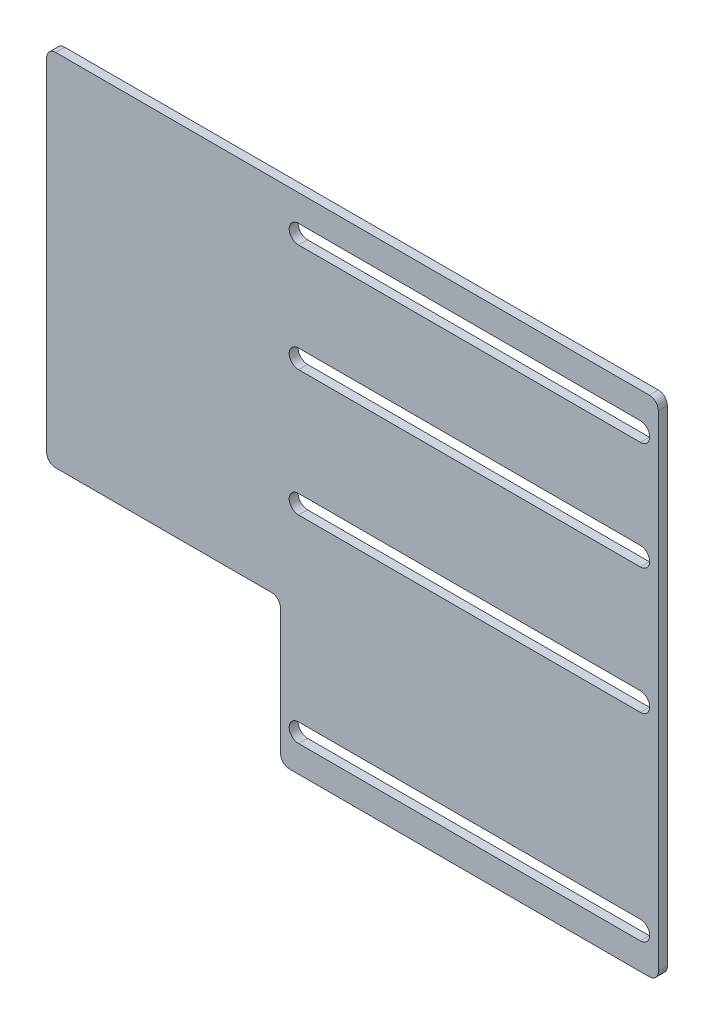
ISO-10303-21;
HEADER;
FILE_DESCRIPTION(('STEP AP214'),'2;1');
FILE_NAME('part.step','',(''),(''),'','','');
FILE_SCHEMA(('AUTOMOTIVE_DESIGN { 1 0 10303 214 1 1 1 1 }'));
ENDSEC;
DATA;
#1=APPLICATION_CONTEXT('core data for automotive mechanical design processes');
#2=APPLICATION_PROTOCOL_DEFINITION('international standard','automotive_design',2000,#1);
#3=PRODUCT_CONTEXT('',#1,'mechanical');
#4=PRODUCT('Part','Part','',(#3));
#5=PRODUCT_RELATED_PRODUCT_CATEGORY('part','',(#4));
#6=PRODUCT_DEFINITION_FORMATION('','',#4);
#7=PRODUCT_DEFINITION_CONTEXT('part definition',#1,'design');
#8=PRODUCT_DEFINITION('design','',#6,#7);
#9=PRODUCT_DEFINITION_SHAPE('','',#8);
#10=(LENGTH_UNIT() NAMED_UNIT(*) SI_UNIT(.MILLI.,.METRE.));
#11=(NAMED_UNIT(*) PLANE_ANGLE_UNIT() SI_UNIT($,.RADIAN.));
#12=(NAMED_UNIT(*) SI_UNIT($,.STERADIAN.) SOLID_ANGLE_UNIT());
#13=UNCERTAINTY_MEASURE_WITH_UNIT(LENGTH_MEASURE(1.E-05),#10,'distance_accuracy_value','');
#14=(GEOMETRIC_REPRESENTATION_CONTEXT(3) GLOBAL_UNCERTAINTY_ASSIGNED_CONTEXT((#13)) GLOBAL_UNIT_ASSIGNED_CONTEXT((#10,
#11,#12)) REPRESENTATION_CONTEXT('',''));
#15=CARTESIAN_POINT('',(0.,0.,0.));
#16=DIRECTION('',(0.,0.,1.));
#17=DIRECTION('',(1.,0.,0.));
#18=AXIS2_PLACEMENT_3D('',#15,#16,#17);
#19=CARTESIAN_POINT('',(133.35,0.,3.175));
#20=DIRECTION('',(0.,1.,0.));
#21=DIRECTION('',(-1.,0.,0.));
#22=AXIS2_PLACEMENT_3D('',#19,#20,#21);
#23=PLANE('',#22);
#24=DIRECTION('',(1.,0.,0.));
#25=VECTOR('',#24,1.);
#26=CARTESIAN_POINT('',(133.35,0.,0.));
#27=LINE('',#26,#25);
#28=CARTESIAN_POINT('',(3.17500000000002,0.,0.));
#29=VERTEX_POINT('',#28);
#30=CARTESIAN_POINT('',(130.175,0.,0.));
#31=VERTEX_POINT('',#30);
#32=EDGE_CURVE('E352',#29,#31,#27,.T.);
#33=ORIENTED_EDGE('',*,*,#32,.T.);
#34=DIRECTION('',(0.,0.,-1.));
#35=VECTOR('',#34,1.);
#36=CARTESIAN_POINT('',(130.175,0.,3.175));
#37=LINE('',#36,#35);
#38=CARTESIAN_POINT('',(130.175,0.,3.175));
#39=VERTEX_POINT('',#38);
#40=EDGE_CURVE('E409',#31,#39,#37,.F.);
#41=ORIENTED_EDGE('',*,*,#40,.T.);
#42=DIRECTION('',(1.,0.,0.));
#43=VECTOR('',#42,1.);
#44=CARTESIAN_POINT('',(133.35,0.,3.175));
#45=LINE('',#44,#43);
#46=CARTESIAN_POINT('',(3.17500000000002,0.,3.175));
#47=VERTEX_POINT('',#46);
#48=EDGE_CURVE('E359',#47,#39,#45,.T.);
#49=ORIENTED_EDGE('',*,*,#48,.F.);
#50=DIRECTION('',(0.,0.,-1.));
#51=VECTOR('',#50,1.);
#52=CARTESIAN_POINT('',(3.17500000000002,0.,3.175));
#53=LINE('',#52,#51);
#54=EDGE_CURVE('E406',#47,#29,#53,.T.);
#55=ORIENTED_EDGE('',*,*,#54,.T.);
#56=EDGE_LOOP('',(#33,#41,#49,#55));
#57=FACE_BOUND('',#56,.T.);
#58=ADVANCED_FACE('F34',(#57),#23,.F.);
#59=CARTESIAN_POINT('',(133.35,177.8,3.17500000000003));
#60=DIRECTION('',(-1.,0.,0.));
#61=DIRECTION('',(0.,-1.,0.));
#62=AXIS2_PLACEMENT_3D('',#59,#60,#61);
#63=PLANE('',#62);
#64=DIRECTION('',(0.,1.,0.));
#65=VECTOR('',#64,1.);
#66=CARTESIAN_POINT('',(133.35,177.8,3.17500000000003));
#67=LINE('',#66,#65);
#68=CARTESIAN_POINT('',(133.35,3.17499999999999,3.175));
#69=VERTEX_POINT('',#68);
#70=CARTESIAN_POINT('',(133.35,174.625,3.17500000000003));
#71=VERTEX_POINT('',#70);
#72=EDGE_CURVE('E362',#69,#71,#67,.T.);
#73=ORIENTED_EDGE('',*,*,#72,.F.);
#74=DIRECTION('',(0.,0.,-1.));
#75=VECTOR('',#74,1.);
#76=CARTESIAN_POINT('',(133.35,3.17499999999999,3.175));
#77=LINE('',#76,#75);
#78=CARTESIAN_POINT('',(133.35,3.17499999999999,0.));
#79=VERTEX_POINT('',#78);
#80=EDGE_CURVE('E393',#69,#79,#77,.T.);
#81=ORIENTED_EDGE('',*,*,#80,.T.);
#82=DIRECTION('',(0.,1.,0.));
#83=VECTOR('',#82,1.);
#84=CARTESIAN_POINT('',(133.35,177.8,0.));
#85=LINE('',#84,#83);
#86=CARTESIAN_POINT('',(133.35,174.625,0.));
#87=VERTEX_POINT('',#86);
#88=EDGE_CURVE('E379',#79,#87,#85,.T.);
#89=ORIENTED_EDGE('',*,*,#88,.T.);
#90=DIRECTION('',(0.,0.,-1.));
#91=VECTOR('',#90,1.);
#92=CARTESIAN_POINT('',(133.35,174.625,3.17500000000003));
#93=LINE('',#92,#91);
#94=EDGE_CURVE('E376',#87,#71,#93,.F.);
#95=ORIENTED_EDGE('',*,*,#94,.T.);
#96=EDGE_LOOP('',(#73,#81,#89,#95));
#97=FACE_BOUND('',#96,.T.);
#98=ADVANCED_FACE('F467',(#97),#63,.F.);
#99=CARTESIAN_POINT('',(-82.5500000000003,177.8,3.17500000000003));
#100=DIRECTION('',(0.,-1.,0.));
#101=DIRECTION('',(0.,0.,-1.));
#102=AXIS2_PLACEMENT_3D('',#99,#100,#101);
#103=PLANE('',#102);
#104=DIRECTION('',(-1.,0.,0.));
#105=VECTOR('',#104,1.);
#106=CARTESIAN_POINT('',(-82.5500000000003,177.8,3.17500000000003));
#107=LINE('',#106,#105);
#108=CARTESIAN_POINT('',(130.175,177.8,3.17500000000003));
#109=VERTEX_POINT('',#108);
#110=CARTESIAN_POINT('',(-79.3750000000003,177.8,3.17500000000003));
#111=VERTEX_POINT('',#110);
#112=EDGE_CURVE('E366',#109,#111,#107,.T.);
#113=ORIENTED_EDGE('',*,*,#112,.F.);
#114=DIRECTION('',(0.,0.,-1.));
#115=VECTOR('',#114,1.);
#116=CARTESIAN_POINT('',(130.175,177.8,3.17500000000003));
#117=LINE('',#116,#115);
#118=CARTESIAN_POINT('',(130.175,177.8,0.));
#119=VERTEX_POINT('',#118);
#120=EDGE_CURVE('E423',#109,#119,#117,.T.);
#121=ORIENTED_EDGE('',*,*,#120,.T.);
#122=DIRECTION('',(-1.,0.,0.));
#123=VECTOR('',#122,1.);
#124=CARTESIAN_POINT('',(-82.5500000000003,177.8,0.));
#125=LINE('',#124,#123);
#126=CARTESIAN_POINT('',(-79.3750000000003,177.8,0.));
#127=VERTEX_POINT('',#126);
#128=EDGE_CURVE('E382',#119,#127,#125,.T.);
#129=ORIENTED_EDGE('',*,*,#128,.T.);
#130=DIRECTION('',(0.,0.,-1.));
#131=VECTOR('',#130,1.);
#132=CARTESIAN_POINT('',(-79.3750000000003,177.8,3.17500000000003));
#133=LINE('',#132,#131);
#134=EDGE_CURVE('E421',#127,#111,#133,.F.);
#135=ORIENTED_EDGE('',*,*,#134,.T.);
#136=EDGE_LOOP('',(#113,#121,#129,#135));
#137=FACE_BOUND('',#136,.T.);
#138=ADVANCED_FACE('F476',(#137),#103,.F.);
#139=CARTESIAN_POINT('',(-82.5500000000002,50.8,3.17500000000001));
#140=DIRECTION('',(1.,0.,0.));
#141=DIRECTION('',(0.,1.,0.));
#142=AXIS2_PLACEMENT_3D('',#139,#140,#141);
#143=PLANE('',#142);
#144=DIRECTION('',(0.,-1.,0.));
#145=VECTOR('',#144,1.);
#146=CARTESIAN_POINT('',(-82.5500000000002,50.8,0.));
#147=LINE('',#146,#145);
#148=CARTESIAN_POINT('',(-82.5500000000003,174.625,0.));
#149=VERTEX_POINT('',#148);
#150=CARTESIAN_POINT('',(-82.5500000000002,53.975,0.));
#151=VERTEX_POINT('',#150);
#152=EDGE_CURVE('E385',#149,#151,#147,.T.);
#153=ORIENTED_EDGE('',*,*,#152,.T.);
#154=DIRECTION('',(0.,0.,-1.));
#155=VECTOR('',#154,1.);
#156=CARTESIAN_POINT('',(-82.5500000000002,53.975,3.17500000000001));
#157=LINE('',#156,#155);
#158=CARTESIAN_POINT('',(-82.5500000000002,53.975,3.17500000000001));
#159=VERTEX_POINT('',#158);
#160=EDGE_CURVE('E438',#151,#159,#157,.F.);
#161=ORIENTED_EDGE('',*,*,#160,.T.);
#162=DIRECTION('',(0.,-1.,0.));
#163=VECTOR('',#162,1.);
#164=CARTESIAN_POINT('',(-82.5500000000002,50.8,3.17500000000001));
#165=LINE('',#164,#163);
#166=CARTESIAN_POINT('',(-82.5500000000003,174.625,3.17500000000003));
#167=VERTEX_POINT('',#166);
#168=EDGE_CURVE('E369',#167,#159,#165,.T.);
#169=ORIENTED_EDGE('',*,*,#168,.F.);
#170=DIRECTION('',(0.,0.,-1.));
#171=VECTOR('',#170,1.);
#172=CARTESIAN_POINT('',(-82.5500000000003,174.625,3.17500000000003));
#173=LINE('',#172,#171);
#174=EDGE_CURVE('E435',#167,#149,#173,.T.);
#175=ORIENTED_EDGE('',*,*,#174,.T.);
#176=EDGE_LOOP('',(#153,#161,#169,#175));
#177=FACE_BOUND('',#176,.T.);
#178=ADVANCED_FACE('F484',(#177),#143,.F.);
#179=CARTESIAN_POINT('',(0.,50.8,3.17500000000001));
#180=DIRECTION('',(0.,1.,0.));
#181=DIRECTION('',(-1.,0.,0.));
#182=AXIS2_PLACEMENT_3D('',#179,#180,#181);
#183=PLANE('',#182);
#184=DIRECTION('',(1.,0.,0.));
#185=VECTOR('',#184,1.);
#186=CARTESIAN_POINT('',(0.,50.8,0.));
#187=LINE('',#186,#185);
#188=CARTESIAN_POINT('',(-79.3750000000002,50.8,0.));
#189=VERTEX_POINT('',#188);
#190=CARTESIAN_POINT('',(-3.17500000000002,50.8,0.));
#191=VERTEX_POINT('',#190);
#192=EDGE_CURVE('E388',#189,#191,#187,.T.);
#193=ORIENTED_EDGE('',*,*,#192,.T.);
#194=DIRECTION('',(0.,0.,-1.));
#195=VECTOR('',#194,1.);
#196=CARTESIAN_POINT('',(-3.17500000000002,50.8,3.17500000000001));
#197=LINE('',#196,#195);
#198=CARTESIAN_POINT('',(-3.17500000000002,50.8,3.17500000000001));
#199=VERTEX_POINT('',#198);
#200=EDGE_CURVE('E433',#191,#199,#197,.F.);
#201=ORIENTED_EDGE('',*,*,#200,.T.);
#202=DIRECTION('',(1.,0.,0.));
#203=VECTOR('',#202,1.);
#204=CARTESIAN_POINT('',(0.,50.8,3.17500000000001));
#205=LINE('',#204,#203);
#206=CARTESIAN_POINT('',(-79.3750000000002,50.8,3.17500000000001));
#207=VERTEX_POINT('',#206);
#208=EDGE_CURVE('E372',#207,#199,#205,.T.);
#209=ORIENTED_EDGE('',*,*,#208,.F.);
#210=DIRECTION('',(0.,0.,-1.));
#211=VECTOR('',#210,1.);
#212=CARTESIAN_POINT('',(-79.3750000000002,50.8,3.17500000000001));
#213=LINE('',#212,#211);
#214=EDGE_CURVE('E430',#207,#189,#213,.T.);
#215=ORIENTED_EDGE('',*,*,#214,.T.);
#216=EDGE_LOOP('',(#193,#201,#209,#215));
#217=FACE_BOUND('',#216,.T.);
#218=ADVANCED_FACE('F447',(#217),#183,.F.);
#219=CARTESIAN_POINT('',(0.,0.,3.175));
#220=DIRECTION('',(1.,0.,0.));
#221=DIRECTION('',(0.,0.,-1.));
#222=AXIS2_PLACEMENT_3D('',#219,#220,#221);
#223=PLANE('',#222);
#224=DIRECTION('',(0.,-1.,0.));
#225=VECTOR('',#224,1.);
#226=CARTESIAN_POINT('',(0.,0.,3.175));
#227=LINE('',#226,#225);
#228=CARTESIAN_POINT('',(0.,47.625,3.17500000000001));
#229=VERTEX_POINT('',#228);
#230=CARTESIAN_POINT('',(0.,3.175,3.175));
#231=VERTEX_POINT('',#230);
#232=EDGE_CURVE('E374',#229,#231,#227,.T.);
#233=ORIENTED_EDGE('',*,*,#232,.F.);
#234=DIRECTION('',(0.,0.,-1.));
#235=VECTOR('',#234,1.);
#236=CARTESIAN_POINT('',(0.,47.625,0.));
#237=LINE('',#236,#235);
#238=CARTESIAN_POINT('',(0.,47.625,0.));
#239=VERTEX_POINT('',#238);
#240=EDGE_CURVE('E427',#229,#239,#237,.T.);
#241=ORIENTED_EDGE('',*,*,#240,.T.);
#242=DIRECTION('',(0.,-1.,0.));
#243=VECTOR('',#242,1.);
#244=CARTESIAN_POINT('',(0.,0.,0.));
#245=LINE('',#244,#243);
#246=CARTESIAN_POINT('',(0.,3.175,0.));
#247=VERTEX_POINT('',#246);
#248=EDGE_CURVE('E363',#239,#247,#245,.T.);
#249=ORIENTED_EDGE('',*,*,#248,.T.);
#250=DIRECTION('',(0.,0.,-1.));
#251=VECTOR('',#250,1.);
#252=CARTESIAN_POINT('',(0.,3.175,3.175));
#253=LINE('',#252,#251);
#254=EDGE_CURVE('E49',#247,#231,#253,.F.);
#255=ORIENTED_EDGE('',*,*,#254,.T.);
#256=EDGE_LOOP('',(#233,#241,#249,#255));
#257=FACE_BOUND('',#256,.T.);
#258=ADVANCED_FACE('F451',(#257),#223,.F.);
#259=CARTESIAN_POINT('',(0.,0.,3.175));
#260=DIRECTION('',(0.,0.,-1.));
#261=DIRECTION('',(-1.,0.,0.));
#262=AXIS2_PLACEMENT_3D('',#259,#260,#261);
#263=PLANE('',#262);
#264=DIRECTION('',(1.,0.,0.));
#265=VECTOR('',#264,1.);
#266=CARTESIAN_POINT('',(6.34999999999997,9.398,3.175));
#267=LINE('',#266,#265);
#268=CARTESIAN_POINT('',(6.34999999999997,9.398,3.175));
#269=VERTEX_POINT('',#268);
#270=CARTESIAN_POINT('',(127.,9.39799999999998,3.175));
#271=VERTEX_POINT('',#270);
#272=EDGE_CURVE('E253',#269,#271,#267,.T.);
#273=ORIENTED_EDGE('',*,*,#272,.F.);
#274=CARTESIAN_POINT('',(6.34999999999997,12.7,3.175));
#275=DIRECTION('',(0.,0.,1.));
#276=DIRECTION('',(1.,0.,0.));
#277=AXIS2_PLACEMENT_3D('',#274,#275,#276);
#278=CIRCLE('',#277,3.302);
#279=CARTESIAN_POINT('',(6.34999999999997,16.002,3.175));
#280=VERTEX_POINT('',#279);
#281=EDGE_CURVE('E226',#280,#269,#278,.T.);
#282=ORIENTED_EDGE('',*,*,#281,.F.);
#283=DIRECTION('',(-1.,0.,0.));
#284=VECTOR('',#283,1.);
#285=CARTESIAN_POINT('',(6.34999999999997,16.002,3.175));
#286=LINE('',#285,#284);
#287=CARTESIAN_POINT('',(127.,16.002,3.175));
#288=VERTEX_POINT('',#287);
#289=EDGE_CURVE('E244',#288,#280,#286,.T.);
#290=ORIENTED_EDGE('',*,*,#289,.F.);
#291=CARTESIAN_POINT('',(127.,12.7,3.175));
#292=DIRECTION('',(0.,0.,1.));
#293=DIRECTION('',(1.,0.,0.));
#294=AXIS2_PLACEMENT_3D('',#291,#292,#293);
#295=CIRCLE('',#294,3.302);
#296=EDGE_CURVE('E247',#271,#288,#295,.T.);
#297=ORIENTED_EDGE('',*,*,#296,.F.);
#298=EDGE_LOOP('',(#273,#282,#290,#297));
#299=FACE_BOUND('',#298,.T.);
#300=DIRECTION('',(1.,0.,0.));
#301=VECTOR('',#300,1.);
#302=CARTESIAN_POINT('',(6.34999999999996,79.248,3.17500000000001));
#303=LINE('',#302,#301);
#304=CARTESIAN_POINT('',(6.34999999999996,79.248,3.17500000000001));
#305=VERTEX_POINT('',#304);
#306=CARTESIAN_POINT('',(127.,79.248,3.17500000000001));
#307=VERTEX_POINT('',#306);
#308=EDGE_CURVE('E278',#305,#307,#303,.T.);
#309=ORIENTED_EDGE('',*,*,#308,.F.);
#310=CARTESIAN_POINT('',(6.34999999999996,82.55,3.17500000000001));
#311=DIRECTION('',(0.,0.,1.));
#312=DIRECTION('',(1.,0.,0.));
#313=AXIS2_PLACEMENT_3D('',#310,#311,#312);
#314=CIRCLE('',#313,3.302);
#315=CARTESIAN_POINT('',(6.34999999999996,85.852,3.17500000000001));
#316=VERTEX_POINT('',#315);
#317=EDGE_CURVE('E259',#316,#305,#314,.T.);
#318=ORIENTED_EDGE('',*,*,#317,.F.);
#319=DIRECTION('',(-1.,0.,0.));
#320=VECTOR('',#319,1.);
#321=CARTESIAN_POINT('',(6.34999999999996,85.852,3.17500000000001));
#322=LINE('',#321,#320);
#323=CARTESIAN_POINT('',(127.,85.852,3.17500000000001));
#324=VERTEX_POINT('',#323);
#325=EDGE_CURVE('E267',#324,#316,#322,.T.);
#326=ORIENTED_EDGE('',*,*,#325,.F.);
#327=CARTESIAN_POINT('',(127.,82.55,3.17500000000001));
#328=DIRECTION('',(0.,0.,1.));
#329=DIRECTION('',(1.,0.,0.));
#330=AXIS2_PLACEMENT_3D('',#327,#328,#329);
#331=CIRCLE('',#330,3.302);
#332=EDGE_CURVE('E281',#307,#324,#331,.T.);
#333=ORIENTED_EDGE('',*,*,#332,.F.);
#334=EDGE_LOOP('',(#309,#318,#326,#333));
#335=FACE_BOUND('',#334,.T.);
#336=DIRECTION('',(1.,0.,0.));
#337=VECTOR('',#336,1.);
#338=CARTESIAN_POINT('',(6.34999999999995,123.698,3.17500000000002));
#339=LINE('',#338,#337);
#340=CARTESIAN_POINT('',(6.34999999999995,123.698,3.17500000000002));
#341=VERTEX_POINT('',#340);
#342=CARTESIAN_POINT('',(127.,123.698,3.17500000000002));
#343=VERTEX_POINT('',#342);
#344=EDGE_CURVE('E310',#341,#343,#339,.T.);
#345=ORIENTED_EDGE('',*,*,#344,.F.);
#346=CARTESIAN_POINT('',(6.34999999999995,127.,3.17500000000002));
#347=DIRECTION('',(0.,0.,1.));
#348=DIRECTION('',(1.,0.,0.));
#349=AXIS2_PLACEMENT_3D('',#346,#347,#348);
#350=CIRCLE('',#349,3.302);
#351=CARTESIAN_POINT('',(6.34999999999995,130.302,3.17500000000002));
#352=VERTEX_POINT('',#351);
#353=EDGE_CURVE('E288',#352,#341,#350,.T.);
#354=ORIENTED_EDGE('',*,*,#353,.F.);
#355=DIRECTION('',(-1.,0.,0.));
#356=VECTOR('',#355,1.);
#357=CARTESIAN_POINT('',(6.34999999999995,130.302,3.17500000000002));
#358=LINE('',#357,#356);
#359=CARTESIAN_POINT('',(127.,130.302,3.17500000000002));
#360=VERTEX_POINT('',#359);
#361=EDGE_CURVE('E299',#360,#352,#358,.T.);
#362=ORIENTED_EDGE('',*,*,#361,.F.);
#363=CARTESIAN_POINT('',(127.,127.,3.17500000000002));
#364=DIRECTION('',(0.,0.,1.));
#365=DIRECTION('',(1.,0.,0.));
#366=AXIS2_PLACEMENT_3D('',#363,#364,#365);
#367=CIRCLE('',#366,3.302);
#368=EDGE_CURVE('E313',#343,#360,#367,.T.);
#369=ORIENTED_EDGE('',*,*,#368,.F.);
#370=EDGE_LOOP('',(#345,#354,#362,#369));
#371=FACE_BOUND('',#370,.T.);
#372=DIRECTION('',(1.,0.,0.));
#373=VECTOR('',#372,1.);
#374=CARTESIAN_POINT('',(6.34999999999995,161.798,3.17500000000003));
#375=LINE('',#374,#373);
#376=CARTESIAN_POINT('',(6.34999999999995,161.798,3.17500000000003));
#377=VERTEX_POINT('',#376);
#378=CARTESIAN_POINT('',(127.,161.798,3.17500000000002));
#379=VERTEX_POINT('',#378);
#380=EDGE_CURVE('E342',#377,#379,#375,.T.);
#381=ORIENTED_EDGE('',*,*,#380,.F.);
#382=CARTESIAN_POINT('',(6.34999999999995,165.1,3.17500000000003));
#383=DIRECTION('',(0.,0.,1.));
#384=DIRECTION('',(1.,0.,0.));
#385=AXIS2_PLACEMENT_3D('',#382,#383,#384);
#386=CIRCLE('',#385,3.302);
#387=CARTESIAN_POINT('',(6.34999999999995,168.402,3.17500000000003));
#388=VERTEX_POINT('',#387);
#389=EDGE_CURVE('E320',#388,#377,#386,.T.);
#390=ORIENTED_EDGE('',*,*,#389,.F.);
#391=DIRECTION('',(-1.,0.,0.));
#392=VECTOR('',#391,1.);
#393=CARTESIAN_POINT('',(6.34999999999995,168.402,3.17500000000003));
#394=LINE('',#393,#392);
#395=CARTESIAN_POINT('',(127.,168.402,3.17500000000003));
#396=VERTEX_POINT('',#395);
#397=EDGE_CURVE('E331',#396,#388,#394,.T.);
#398=ORIENTED_EDGE('',*,*,#397,.F.);
#399=CARTESIAN_POINT('',(127.,165.1,3.17500000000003));
#400=DIRECTION('',(0.,0.,1.));
#401=DIRECTION('',(1.,0.,0.));
#402=AXIS2_PLACEMENT_3D('',#399,#400,#401);
#403=CIRCLE('',#402,3.302);
#404=EDGE_CURVE('E345',#379,#396,#403,.T.);
#405=ORIENTED_EDGE('',*,*,#404,.F.);
#406=EDGE_LOOP('',(#381,#390,#398,#405));
#407=FACE_BOUND('',#406,.T.);
#408=ORIENTED_EDGE('',*,*,#48,.T.);
#409=CARTESIAN_POINT('',(130.175,3.17499999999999,3.175));
#410=DIRECTION('',(0.,0.,-1.));
#411=DIRECTION('',(-1.,0.,0.));
#412=AXIS2_PLACEMENT_3D('',#409,#410,#411);
#413=CIRCLE('',#412,3.175);
#414=EDGE_CURVE('E419',#39,#69,#413,.F.);
#415=ORIENTED_EDGE('',*,*,#414,.T.);
#416=ORIENTED_EDGE('',*,*,#72,.T.);
#417=CARTESIAN_POINT('',(130.175,174.625,3.17500000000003));
#418=DIRECTION('',(0.,0.,-1.));
#419=DIRECTION('',(-1.,0.,0.));
#420=AXIS2_PLACEMENT_3D('',#417,#418,#419);
#421=CIRCLE('',#420,3.175);
#422=EDGE_CURVE('E417',#71,#109,#421,.F.);
#423=ORIENTED_EDGE('',*,*,#422,.T.);
#424=ORIENTED_EDGE('',*,*,#112,.T.);
#425=CARTESIAN_POINT('',(-79.3750000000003,174.625,3.17500000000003));
#426=DIRECTION('',(0.,0.,-1.));
#427=DIRECTION('',(-1.,0.,0.));
#428=AXIS2_PLACEMENT_3D('',#425,#426,#427);
#429=CIRCLE('',#428,3.175);
#430=EDGE_CURVE('E411',#111,#167,#429,.F.);
#431=ORIENTED_EDGE('',*,*,#430,.T.);
#432=ORIENTED_EDGE('',*,*,#168,.T.);
#433=CARTESIAN_POINT('',(-79.3750000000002,53.975,3.17500000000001));
#434=DIRECTION('',(0.,0.,-1.));
#435=DIRECTION('',(-1.,0.,0.));
#436=AXIS2_PLACEMENT_3D('',#433,#434,#435);
#437=CIRCLE('',#436,3.175);
#438=EDGE_CURVE('E413',#159,#207,#437,.F.);
#439=ORIENTED_EDGE('',*,*,#438,.T.);
#440=ORIENTED_EDGE('',*,*,#208,.T.);
#441=CARTESIAN_POINT('',(-3.17500000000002,47.625,3.17500000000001));
#442=DIRECTION('',(0.,0.,-1.));
#443=DIRECTION('',(-1.,0.,0.));
#444=AXIS2_PLACEMENT_3D('',#441,#442,#443);
#445=CIRCLE('',#444,3.175);
#446=EDGE_CURVE('E11',#199,#229,#445,.T.);
#447=ORIENTED_EDGE('',*,*,#446,.T.);
#448=ORIENTED_EDGE('',*,*,#232,.T.);
#449=CARTESIAN_POINT('',(3.17500000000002,3.175,3.175));
#450=DIRECTION('',(0.,0.,-1.));
#451=DIRECTION('',(-1.,0.,0.));
#452=AXIS2_PLACEMENT_3D('',#449,#450,#451);
#453=CIRCLE('',#452,3.175);
#454=EDGE_CURVE('E415',#231,#47,#453,.F.);
#455=ORIENTED_EDGE('',*,*,#454,.T.);
#456=EDGE_LOOP('',(#408,#415,#416,#423,#424,#431,#432,#439,#440,#447,#448,#455));
#457=FACE_BOUND('',#456,.T.);
#458=ADVANCED_FACE('F453',(#299,#335,#371,#407,#457),#263,.F.);
#459=CARTESIAN_POINT('',(0.,0.,0.));
#460=DIRECTION('',(0.,0.,-1.));
#461=DIRECTION('',(-1.,0.,0.));
#462=AXIS2_PLACEMENT_3D('',#459,#460,#461);
#463=PLANE('',#462);
#464=CARTESIAN_POINT('',(6.34999999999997,12.7,0.));
#465=DIRECTION('',(0.,0.,1.));
#466=DIRECTION('',(1.,0.,0.));
#467=AXIS2_PLACEMENT_3D('',#464,#465,#466);
#468=CIRCLE('',#467,3.302);
#469=CARTESIAN_POINT('',(6.34999999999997,16.002,0.));
#470=VERTEX_POINT('',#469);
#471=CARTESIAN_POINT('',(6.34999999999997,9.398,0.));
#472=VERTEX_POINT('',#471);
#473=EDGE_CURVE('E223',#470,#472,#468,.T.);
#474=ORIENTED_EDGE('',*,*,#473,.T.);
#475=DIRECTION('',(1.,0.,0.));
#476=VECTOR('',#475,1.);
#477=CARTESIAN_POINT('',(6.34999999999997,9.398,0.));
#478=LINE('',#477,#476);
#479=CARTESIAN_POINT('',(127.,9.39799999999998,0.));
#480=VERTEX_POINT('',#479);
#481=EDGE_CURVE('E235',#472,#480,#478,.T.);
#482=ORIENTED_EDGE('',*,*,#481,.T.);
#483=CARTESIAN_POINT('',(127.,12.7,0.));
#484=DIRECTION('',(0.,0.,1.));
#485=DIRECTION('',(1.,0.,0.));
#486=AXIS2_PLACEMENT_3D('',#483,#484,#485);
#487=CIRCLE('',#486,3.302);
#488=CARTESIAN_POINT('',(127.,16.002,0.));
#489=VERTEX_POINT('',#488);
#490=EDGE_CURVE('E239',#480,#489,#487,.T.);
#491=ORIENTED_EDGE('',*,*,#490,.T.);
#492=DIRECTION('',(-1.,0.,0.));
#493=VECTOR('',#492,1.);
#494=CARTESIAN_POINT('',(6.34999999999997,16.002,0.));
#495=LINE('',#494,#493);
#496=EDGE_CURVE('E231',#489,#470,#495,.T.);
#497=ORIENTED_EDGE('',*,*,#496,.T.);
#498=EDGE_LOOP('',(#474,#482,#491,#497));
#499=FACE_BOUND('',#498,.T.);
#500=CARTESIAN_POINT('',(6.34999999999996,82.55,0.));
#501=DIRECTION('',(0.,0.,1.));
#502=DIRECTION('',(1.,0.,0.));
#503=AXIS2_PLACEMENT_3D('',#500,#501,#502);
#504=CIRCLE('',#503,3.302);
#505=CARTESIAN_POINT('',(6.34999999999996,85.852,0.));
#506=VERTEX_POINT('',#505);
#507=CARTESIAN_POINT('',(6.34999999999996,79.248,0.));
#508=VERTEX_POINT('',#507);
#509=EDGE_CURVE('E263',#506,#508,#504,.T.);
#510=ORIENTED_EDGE('',*,*,#509,.T.);
#511=DIRECTION('',(1.,0.,0.));
#512=VECTOR('',#511,1.);
#513=CARTESIAN_POINT('',(6.34999999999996,79.248,0.));
#514=LINE('',#513,#512);
#515=CARTESIAN_POINT('',(127.,79.248,0.));
#516=VERTEX_POINT('',#515);
#517=EDGE_CURVE('E266',#508,#516,#514,.T.);
#518=ORIENTED_EDGE('',*,*,#517,.T.);
#519=CARTESIAN_POINT('',(127.,82.55,0.));
#520=DIRECTION('',(0.,0.,1.));
#521=DIRECTION('',(1.,0.,0.));
#522=AXIS2_PLACEMENT_3D('',#519,#520,#521);
#523=CIRCLE('',#522,3.302);
#524=CARTESIAN_POINT('',(127.,85.852,0.));
#525=VERTEX_POINT('',#524);
#526=EDGE_CURVE('E270',#516,#525,#523,.T.);
#527=ORIENTED_EDGE('',*,*,#526,.T.);
#528=DIRECTION('',(-1.,0.,0.));
#529=VECTOR('',#528,1.);
#530=CARTESIAN_POINT('',(6.34999999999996,85.852,0.));
#531=LINE('',#530,#529);
#532=EDGE_CURVE('E273',#525,#506,#531,.T.);
#533=ORIENTED_EDGE('',*,*,#532,.T.);
#534=EDGE_LOOP('',(#510,#518,#527,#533));
#535=FACE_BOUND('',#534,.T.);
#536=CARTESIAN_POINT('',(6.34999999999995,127.,0.));
#537=DIRECTION('',(0.,0.,1.));
#538=DIRECTION('',(1.,0.,0.));
#539=AXIS2_PLACEMENT_3D('',#536,#537,#538);
#540=CIRCLE('',#539,3.302);
#541=CARTESIAN_POINT('',(6.34999999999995,130.302,0.));
#542=VERTEX_POINT('',#541);
#543=CARTESIAN_POINT('',(6.34999999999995,123.698,0.));
#544=VERTEX_POINT('',#543);
#545=EDGE_CURVE('E295',#542,#544,#540,.T.);
#546=ORIENTED_EDGE('',*,*,#545,.T.);
#547=DIRECTION('',(1.,0.,0.));
#548=VECTOR('',#547,1.);
#549=CARTESIAN_POINT('',(6.34999999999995,123.698,0.));
#550=LINE('',#549,#548);
#551=CARTESIAN_POINT('',(127.,123.698,0.));
#552=VERTEX_POINT('',#551);
#553=EDGE_CURVE('E298',#544,#552,#550,.T.);
#554=ORIENTED_EDGE('',*,*,#553,.T.);
#555=CARTESIAN_POINT('',(127.,127.,0.));
#556=DIRECTION('',(0.,0.,1.));
#557=DIRECTION('',(1.,0.,0.));
#558=AXIS2_PLACEMENT_3D('',#555,#556,#557);
#559=CIRCLE('',#558,3.302);
#560=CARTESIAN_POINT('',(127.,130.302,0.));
#561=VERTEX_POINT('',#560);
#562=EDGE_CURVE('E302',#552,#561,#559,.T.);
#563=ORIENTED_EDGE('',*,*,#562,.T.);
#564=DIRECTION('',(-1.,0.,0.));
#565=VECTOR('',#564,1.);
#566=CARTESIAN_POINT('',(6.34999999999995,130.302,0.));
#567=LINE('',#566,#565);
#568=EDGE_CURVE('E305',#561,#542,#567,.T.);
#569=ORIENTED_EDGE('',*,*,#568,.T.);
#570=EDGE_LOOP('',(#546,#554,#563,#569));
#571=FACE_BOUND('',#570,.T.);
#572=CARTESIAN_POINT('',(6.34999999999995,165.1,0.));
#573=DIRECTION('',(0.,0.,1.));
#574=DIRECTION('',(1.,0.,0.));
#575=AXIS2_PLACEMENT_3D('',#572,#573,#574);
#576=CIRCLE('',#575,3.302);
#577=CARTESIAN_POINT('',(6.34999999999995,168.402,0.));
#578=VERTEX_POINT('',#577);
#579=CARTESIAN_POINT('',(6.34999999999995,161.798,0.));
#580=VERTEX_POINT('',#579);
#581=EDGE_CURVE('E327',#578,#580,#576,.T.);
#582=ORIENTED_EDGE('',*,*,#581,.T.);
#583=DIRECTION('',(1.,0.,0.));
#584=VECTOR('',#583,1.);
#585=CARTESIAN_POINT('',(6.34999999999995,161.798,0.));
#586=LINE('',#585,#584);
#587=CARTESIAN_POINT('',(127.,161.798,0.));
#588=VERTEX_POINT('',#587);
#589=EDGE_CURVE('E330',#580,#588,#586,.T.);
#590=ORIENTED_EDGE('',*,*,#589,.T.);
#591=CARTESIAN_POINT('',(127.,165.1,0.));
#592=DIRECTION('',(0.,0.,1.));
#593=DIRECTION('',(1.,0.,0.));
#594=AXIS2_PLACEMENT_3D('',#591,#592,#593);
#595=CIRCLE('',#594,3.302);
#596=CARTESIAN_POINT('',(127.,168.402,0.));
#597=VERTEX_POINT('',#596);
#598=EDGE_CURVE('E334',#588,#597,#595,.T.);
#599=ORIENTED_EDGE('',*,*,#598,.T.);
#600=DIRECTION('',(-1.,0.,0.));
#601=VECTOR('',#600,1.);
#602=CARTESIAN_POINT('',(6.34999999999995,168.402,0.));
#603=LINE('',#602,#601);
#604=EDGE_CURVE('E337',#597,#578,#603,.T.);
#605=ORIENTED_EDGE('',*,*,#604,.T.);
#606=EDGE_LOOP('',(#582,#590,#599,#605));
#607=FACE_BOUND('',#606,.T.);
#608=ORIENTED_EDGE('',*,*,#88,.F.);
#609=CARTESIAN_POINT('',(130.175,3.17499999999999,0.));
#610=DIRECTION('',(0.,0.,-1.));
#611=DIRECTION('',(-1.,0.,0.));
#612=AXIS2_PLACEMENT_3D('',#609,#610,#611);
#613=CIRCLE('',#612,3.175);
#614=EDGE_CURVE('E404',#79,#31,#613,.T.);
#615=ORIENTED_EDGE('',*,*,#614,.T.);
#616=ORIENTED_EDGE('',*,*,#32,.F.);
#617=CARTESIAN_POINT('',(3.17500000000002,3.175,0.));
#618=DIRECTION('',(0.,0.,-1.));
#619=DIRECTION('',(-1.,0.,0.));
#620=AXIS2_PLACEMENT_3D('',#617,#618,#619);
#621=CIRCLE('',#620,3.175);
#622=EDGE_CURVE('E400',#29,#247,#621,.T.);
#623=ORIENTED_EDGE('',*,*,#622,.T.);
#624=ORIENTED_EDGE('',*,*,#248,.F.);
#625=CARTESIAN_POINT('',(-3.17500000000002,47.625,0.));
#626=DIRECTION('',(0.,0.,-1.));
#627=DIRECTION('',(-1.,0.,0.));
#628=AXIS2_PLACEMENT_3D('',#625,#626,#627);
#629=CIRCLE('',#628,3.175);
#630=EDGE_CURVE('E42',#239,#191,#629,.F.);
#631=ORIENTED_EDGE('',*,*,#630,.T.);
#632=ORIENTED_EDGE('',*,*,#192,.F.);
#633=CARTESIAN_POINT('',(-79.3750000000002,53.975,0.));
#634=DIRECTION('',(0.,0.,-1.));
#635=DIRECTION('',(-1.,0.,0.));
#636=AXIS2_PLACEMENT_3D('',#633,#634,#635);
#637=CIRCLE('',#636,3.175);
#638=EDGE_CURVE('E398',#189,#151,#637,.T.);
#639=ORIENTED_EDGE('',*,*,#638,.T.);
#640=ORIENTED_EDGE('',*,*,#152,.F.);
#641=CARTESIAN_POINT('',(-79.3750000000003,174.625,0.));
#642=DIRECTION('',(0.,0.,-1.));
#643=DIRECTION('',(-1.,0.,0.));
#644=AXIS2_PLACEMENT_3D('',#641,#642,#643);
#645=CIRCLE('',#644,3.175);
#646=EDGE_CURVE('E396',#149,#127,#645,.T.);
#647=ORIENTED_EDGE('',*,*,#646,.T.);
#648=ORIENTED_EDGE('',*,*,#128,.F.);
#649=CARTESIAN_POINT('',(130.175,174.625,0.));
#650=DIRECTION('',(0.,0.,-1.));
#651=DIRECTION('',(-1.,0.,0.));
#652=AXIS2_PLACEMENT_3D('',#649,#650,#651);
#653=CIRCLE('',#652,3.175);
#654=EDGE_CURVE('E402',#119,#87,#653,.T.);
#655=ORIENTED_EDGE('',*,*,#654,.T.);
#656=EDGE_LOOP('',(#608,#615,#616,#623,#624,#631,#632,#639,#640,#647,#648,#655));
#657=FACE_BOUND('',#656,.T.);
#658=ADVANCED_FACE('F241',(#499,#535,#571,#607,#657),#463,.T.);
#659=CARTESIAN_POINT('',(6.34999999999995,165.1,0.));
#660=DIRECTION('',(0.,0.,1.));
#661=DIRECTION('',(1.,0.,0.));
#662=AXIS2_PLACEMENT_3D('',#659,#660,#661);
#663=CYLINDRICAL_SURFACE('',#662,3.302);
#664=ORIENTED_EDGE('',*,*,#389,.T.);
#665=DIRECTION('',(0.,0.,1.));
#666=VECTOR('',#665,1.);
#667=CARTESIAN_POINT('',(6.34999999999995,161.798,0.));
#668=LINE('',#667,#666);
#669=EDGE_CURVE('E340',#580,#377,#668,.T.);
#670=ORIENTED_EDGE('',*,*,#669,.F.);
#671=ORIENTED_EDGE('',*,*,#581,.F.);
#672=DIRECTION('',(0.,0.,1.));
#673=VECTOR('',#672,1.);
#674=CARTESIAN_POINT('',(6.34999999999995,168.402,0.));
#675=LINE('',#674,#673);
#676=EDGE_CURVE('E350',#578,#388,#675,.T.);
#677=ORIENTED_EDGE('',*,*,#676,.T.);
#678=EDGE_LOOP('',(#664,#670,#671,#677));
#679=FACE_BOUND('',#678,.T.);
#680=ADVANCED_FACE('F670',(#679),#663,.F.);
#681=CARTESIAN_POINT('',(6.34999999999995,168.402,0.));
#682=DIRECTION('',(0.,1.,0.));
#683=DIRECTION('',(0.,0.,1.));
#684=AXIS2_PLACEMENT_3D('',#681,#682,#683);
#685=PLANE('',#684);
#686=ORIENTED_EDGE('',*,*,#397,.T.);
#687=ORIENTED_EDGE('',*,*,#676,.F.);
#688=ORIENTED_EDGE('',*,*,#604,.F.);
#689=DIRECTION('',(0.,0.,1.));
#690=VECTOR('',#689,1.);
#691=CARTESIAN_POINT('',(127.,168.402,0.));
#692=LINE('',#691,#690);
#693=EDGE_CURVE('E353',#597,#396,#692,.T.);
#694=ORIENTED_EDGE('',*,*,#693,.T.);
#695=EDGE_LOOP('',(#686,#687,#688,#694));
#696=FACE_BOUND('',#695,.T.);
#697=ADVANCED_FACE('F661',(#696),#685,.F.);
#698=CARTESIAN_POINT('',(127.,165.1,0.));
#699=DIRECTION('',(0.,0.,1.));
#700=DIRECTION('',(1.,0.,0.));
#701=AXIS2_PLACEMENT_3D('',#698,#699,#700);
#702=CYLINDRICAL_SURFACE('',#701,3.302);
#703=ORIENTED_EDGE('',*,*,#404,.T.);
#704=ORIENTED_EDGE('',*,*,#693,.F.);
#705=ORIENTED_EDGE('',*,*,#598,.F.);
#706=DIRECTION('',(0.,0.,1.));
#707=VECTOR('',#706,1.);
#708=CARTESIAN_POINT('',(127.,161.798,0.));
#709=LINE('',#708,#707);
#710=EDGE_CURVE('E355',#588,#379,#709,.T.);
#711=ORIENTED_EDGE('',*,*,#710,.T.);
#712=EDGE_LOOP('',(#703,#704,#705,#711));
#713=FACE_BOUND('',#712,.T.);
#714=ADVANCED_FACE('F652',(#713),#702,.F.);
#715=CARTESIAN_POINT('',(6.34999999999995,161.798,0.));
#716=DIRECTION('',(0.,-1.,0.));
#717=DIRECTION('',(0.,0.,-1.));
#718=AXIS2_PLACEMENT_3D('',#715,#716,#717);
#719=PLANE('',#718);
#720=ORIENTED_EDGE('',*,*,#380,.T.);
#721=ORIENTED_EDGE('',*,*,#710,.F.);
#722=ORIENTED_EDGE('',*,*,#589,.F.);
#723=ORIENTED_EDGE('',*,*,#669,.T.);
#724=EDGE_LOOP('',(#720,#721,#722,#723));
#725=FACE_BOUND('',#724,.T.);
#726=ADVANCED_FACE('F643',(#725),#719,.F.);
#727=CARTESIAN_POINT('',(6.34999999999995,127.,0.));
#728=DIRECTION('',(0.,0.,1.));
#729=DIRECTION('',(1.,0.,0.));
#730=AXIS2_PLACEMENT_3D('',#727,#728,#729);
#731=CYLINDRICAL_SURFACE('',#730,3.302);
#732=ORIENTED_EDGE('',*,*,#353,.T.);
#733=DIRECTION('',(0.,0.,1.));
#734=VECTOR('',#733,1.);
#735=CARTESIAN_POINT('',(6.34999999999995,123.698,0.));
#736=LINE('',#735,#734);
#737=EDGE_CURVE('E308',#544,#341,#736,.T.);
#738=ORIENTED_EDGE('',*,*,#737,.F.);
#739=ORIENTED_EDGE('',*,*,#545,.F.);
#740=DIRECTION('',(0.,0.,1.));
#741=VECTOR('',#740,1.);
#742=CARTESIAN_POINT('',(6.34999999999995,130.302,0.));
#743=LINE('',#742,#741);
#744=EDGE_CURVE('E318',#542,#352,#743,.T.);
#745=ORIENTED_EDGE('',*,*,#744,.T.);
#746=EDGE_LOOP('',(#732,#738,#739,#745));
#747=FACE_BOUND('',#746,.T.);
#748=ADVANCED_FACE('F634',(#747),#731,.F.);
#749=CARTESIAN_POINT('',(6.34999999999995,130.302,0.));
#750=DIRECTION('',(0.,1.,0.));
#751=DIRECTION('',(0.,0.,1.));
#752=AXIS2_PLACEMENT_3D('',#749,#750,#751);
#753=PLANE('',#752);
#754=ORIENTED_EDGE('',*,*,#361,.T.);
#755=ORIENTED_EDGE('',*,*,#744,.F.);
#756=ORIENTED_EDGE('',*,*,#568,.F.);
#757=DIRECTION('',(0.,0.,1.));
#758=VECTOR('',#757,1.);
#759=CARTESIAN_POINT('',(127.,130.302,0.));
#760=LINE('',#759,#758);
#761=EDGE_CURVE('E321',#561,#360,#760,.T.);
#762=ORIENTED_EDGE('',*,*,#761,.T.);
#763=EDGE_LOOP('',(#754,#755,#756,#762));
#764=FACE_BOUND('',#763,.T.);
#765=ADVANCED_FACE('F625',(#764),#753,.F.);
#766=CARTESIAN_POINT('',(127.,127.,0.));
#767=DIRECTION('',(0.,0.,1.));
#768=DIRECTION('',(1.,0.,0.));
#769=AXIS2_PLACEMENT_3D('',#766,#767,#768);
#770=CYLINDRICAL_SURFACE('',#769,3.302);
#771=ORIENTED_EDGE('',*,*,#368,.T.);
#772=ORIENTED_EDGE('',*,*,#761,.F.);
#773=ORIENTED_EDGE('',*,*,#562,.F.);
#774=DIRECTION('',(0.,0.,1.));
#775=VECTOR('',#774,1.);
#776=CARTESIAN_POINT('',(127.,123.698,0.));
#777=LINE('',#776,#775);
#778=EDGE_CURVE('E323',#552,#343,#777,.T.);
#779=ORIENTED_EDGE('',*,*,#778,.T.);
#780=EDGE_LOOP('',(#771,#772,#773,#779));
#781=FACE_BOUND('',#780,.T.);
#782=ADVANCED_FACE('F616',(#781),#770,.F.);
#783=CARTESIAN_POINT('',(6.34999999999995,123.698,0.));
#784=DIRECTION('',(0.,-1.,0.));
#785=DIRECTION('',(0.,0.,-1.));
#786=AXIS2_PLACEMENT_3D('',#783,#784,#785);
#787=PLANE('',#786);
#788=ORIENTED_EDGE('',*,*,#344,.T.);
#789=ORIENTED_EDGE('',*,*,#778,.F.);
#790=ORIENTED_EDGE('',*,*,#553,.F.);
#791=ORIENTED_EDGE('',*,*,#737,.T.);
#792=EDGE_LOOP('',(#788,#789,#790,#791));
#793=FACE_BOUND('',#792,.T.);
#794=ADVANCED_FACE('F607',(#793),#787,.F.);
#795=CARTESIAN_POINT('',(6.34999999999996,82.55,0.));
#796=DIRECTION('',(0.,0.,1.));
#797=DIRECTION('',(1.,0.,0.));
#798=AXIS2_PLACEMENT_3D('',#795,#796,#797);
#799=CYLINDRICAL_SURFACE('',#798,3.302);
#800=ORIENTED_EDGE('',*,*,#317,.T.);
#801=DIRECTION('',(0.,0.,1.));
#802=VECTOR('',#801,1.);
#803=CARTESIAN_POINT('',(6.34999999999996,79.248,0.));
#804=LINE('',#803,#802);
#805=EDGE_CURVE('E276',#508,#305,#804,.T.);
#806=ORIENTED_EDGE('',*,*,#805,.F.);
#807=ORIENTED_EDGE('',*,*,#509,.F.);
#808=DIRECTION('',(0.,0.,1.));
#809=VECTOR('',#808,1.);
#810=CARTESIAN_POINT('',(6.34999999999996,85.852,0.));
#811=LINE('',#810,#809);
#812=EDGE_CURVE('E286',#506,#316,#811,.T.);
#813=ORIENTED_EDGE('',*,*,#812,.T.);
#814=EDGE_LOOP('',(#800,#806,#807,#813));
#815=FACE_BOUND('',#814,.T.);
#816=ADVANCED_FACE('F598',(#815),#799,.F.);
#817=CARTESIAN_POINT('',(6.34999999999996,85.852,0.));
#818=DIRECTION('',(0.,1.,0.));
#819=DIRECTION('',(0.,0.,1.));
#820=AXIS2_PLACEMENT_3D('',#817,#818,#819);
#821=PLANE('',#820);
#822=ORIENTED_EDGE('',*,*,#325,.T.);
#823=ORIENTED_EDGE('',*,*,#812,.F.);
#824=ORIENTED_EDGE('',*,*,#532,.F.);
#825=DIRECTION('',(0.,0.,1.));
#826=VECTOR('',#825,1.);
#827=CARTESIAN_POINT('',(127.,85.852,0.));
#828=LINE('',#827,#826);
#829=EDGE_CURVE('E289',#525,#324,#828,.T.);
#830=ORIENTED_EDGE('',*,*,#829,.T.);
#831=EDGE_LOOP('',(#822,#823,#824,#830));
#832=FACE_BOUND('',#831,.T.);
#833=ADVANCED_FACE('F589',(#832),#821,.F.);
#834=CARTESIAN_POINT('',(127.,82.55,0.));
#835=DIRECTION('',(0.,0.,1.));
#836=DIRECTION('',(1.,0.,0.));
#837=AXIS2_PLACEMENT_3D('',#834,#835,#836);
#838=CYLINDRICAL_SURFACE('',#837,3.302);
#839=ORIENTED_EDGE('',*,*,#332,.T.);
#840=ORIENTED_EDGE('',*,*,#829,.F.);
#841=ORIENTED_EDGE('',*,*,#526,.F.);
#842=DIRECTION('',(0.,0.,1.));
#843=VECTOR('',#842,1.);
#844=CARTESIAN_POINT('',(127.,79.248,0.));
#845=LINE('',#844,#843);
#846=EDGE_CURVE('E291',#516,#307,#845,.T.);
#847=ORIENTED_EDGE('',*,*,#846,.T.);
#848=EDGE_LOOP('',(#839,#840,#841,#847));
#849=FACE_BOUND('',#848,.T.);
#850=ADVANCED_FACE('F580',(#849),#838,.F.);
#851=CARTESIAN_POINT('',(6.34999999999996,79.248,0.));
#852=DIRECTION('',(0.,-1.,0.));
#853=DIRECTION('',(0.,0.,-1.));
#854=AXIS2_PLACEMENT_3D('',#851,#852,#853);
#855=PLANE('',#854);
#856=ORIENTED_EDGE('',*,*,#308,.T.);
#857=ORIENTED_EDGE('',*,*,#846,.F.);
#858=ORIENTED_EDGE('',*,*,#517,.F.);
#859=ORIENTED_EDGE('',*,*,#805,.T.);
#860=EDGE_LOOP('',(#856,#857,#858,#859));
#861=FACE_BOUND('',#860,.T.);
#862=ADVANCED_FACE('F572',(#861),#855,.F.);
#863=CARTESIAN_POINT('',(6.34999999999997,12.7,0.));
#864=DIRECTION('',(0.,0.,1.));
#865=DIRECTION('',(1.,0.,0.));
#866=AXIS2_PLACEMENT_3D('',#863,#864,#865);
#867=CYLINDRICAL_SURFACE('',#866,3.302);
#868=ORIENTED_EDGE('',*,*,#281,.T.);
#869=DIRECTION('',(0.,0.,1.));
#870=VECTOR('',#869,1.);
#871=CARTESIAN_POINT('',(6.34999999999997,9.398,0.));
#872=LINE('',#871,#870);
#873=EDGE_CURVE('E219',#472,#269,#872,.T.);
#874=ORIENTED_EDGE('',*,*,#873,.F.);
#875=ORIENTED_EDGE('',*,*,#473,.F.);
#876=DIRECTION('',(0.,0.,1.));
#877=VECTOR('',#876,1.);
#878=CARTESIAN_POINT('',(6.34999999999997,16.002,0.));
#879=LINE('',#878,#877);
#880=EDGE_CURVE('E257',#470,#280,#879,.T.);
#881=ORIENTED_EDGE('',*,*,#880,.T.);
#882=EDGE_LOOP('',(#868,#874,#875,#881));
#883=FACE_BOUND('',#882,.T.);
#884=ADVANCED_FACE('F221',(#883),#867,.F.);
#885=CARTESIAN_POINT('',(6.34999999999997,16.002,0.));
#886=DIRECTION('',(0.,1.,0.));
#887=DIRECTION('',(0.,0.,1.));
#888=AXIS2_PLACEMENT_3D('',#885,#886,#887);
#889=PLANE('',#888);
#890=ORIENTED_EDGE('',*,*,#289,.T.);
#891=ORIENTED_EDGE('',*,*,#880,.F.);
#892=ORIENTED_EDGE('',*,*,#496,.F.);
#893=DIRECTION('',(0.,0.,1.));
#894=VECTOR('',#893,1.);
#895=CARTESIAN_POINT('',(127.,16.002,0.));
#896=LINE('',#895,#894);
#897=EDGE_CURVE('E260',#489,#288,#896,.T.);
#898=ORIENTED_EDGE('',*,*,#897,.T.);
#899=EDGE_LOOP('',(#890,#891,#892,#898));
#900=FACE_BOUND('',#899,.T.);
#901=ADVANCED_FACE('F555',(#900),#889,.F.);
#902=CARTESIAN_POINT('',(127.,12.7,0.));
#903=DIRECTION('',(0.,0.,1.));
#904=DIRECTION('',(1.,0.,0.));
#905=AXIS2_PLACEMENT_3D('',#902,#903,#904);
#906=CYLINDRICAL_SURFACE('',#905,3.302);
#907=ORIENTED_EDGE('',*,*,#296,.T.);
#908=ORIENTED_EDGE('',*,*,#897,.F.);
#909=ORIENTED_EDGE('',*,*,#490,.F.);
#910=DIRECTION('',(0.,0.,1.));
#911=VECTOR('',#910,1.);
#912=CARTESIAN_POINT('',(127.,9.39799999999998,0.));
#913=LINE('',#912,#911);
#914=EDGE_CURVE('E230',#480,#271,#913,.T.);
#915=ORIENTED_EDGE('',*,*,#914,.T.);
#916=EDGE_LOOP('',(#907,#908,#909,#915));
#917=FACE_BOUND('',#916,.T.);
#918=ADVANCED_FACE('F547',(#917),#906,.F.);
#919=CARTESIAN_POINT('',(6.34999999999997,9.398,0.));
#920=DIRECTION('',(0.,-1.,0.));
#921=DIRECTION('',(0.,0.,-1.));
#922=AXIS2_PLACEMENT_3D('',#919,#920,#921);
#923=PLANE('',#922);
#924=ORIENTED_EDGE('',*,*,#272,.T.);
#925=ORIENTED_EDGE('',*,*,#914,.F.);
#926=ORIENTED_EDGE('',*,*,#481,.F.);
#927=ORIENTED_EDGE('',*,*,#873,.T.);
#928=EDGE_LOOP('',(#924,#925,#926,#927));
#929=FACE_BOUND('',#928,.T.);
#930=ADVANCED_FACE('F236',(#929),#923,.F.);
#931=CARTESIAN_POINT('',(130.175,3.17499999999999,3.175));
#932=DIRECTION('',(0.,0.,-1.));
#933=DIRECTION('',(-1.,0.,0.));
#934=AXIS2_PLACEMENT_3D('',#931,#932,#933);
#935=CYLINDRICAL_SURFACE('',#934,3.175);
#936=ORIENTED_EDGE('',*,*,#414,.F.);
#937=ORIENTED_EDGE('',*,*,#40,.F.);
#938=ORIENTED_EDGE('',*,*,#614,.F.);
#939=ORIENTED_EDGE('',*,*,#80,.F.);
#940=EDGE_LOOP('',(#936,#937,#938,#939));
#941=FACE_BOUND('',#940,.T.);
#942=ADVANCED_FACE('F464',(#941),#935,.T.);
#943=CARTESIAN_POINT('',(130.175,174.625,3.17500000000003));
#944=DIRECTION('',(0.,0.,-1.));
#945=DIRECTION('',(-1.,0.,0.));
#946=AXIS2_PLACEMENT_3D('',#943,#944,#945);
#947=CYLINDRICAL_SURFACE('',#946,3.175);
#948=ORIENTED_EDGE('',*,*,#422,.F.);
#949=ORIENTED_EDGE('',*,*,#94,.F.);
#950=ORIENTED_EDGE('',*,*,#654,.F.);
#951=ORIENTED_EDGE('',*,*,#120,.F.);
#952=EDGE_LOOP('',(#948,#949,#950,#951));
#953=FACE_BOUND('',#952,.T.);
#954=ADVANCED_FACE('F473',(#953),#947,.T.);
#955=CARTESIAN_POINT('',(-3.17500000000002,47.625,3.17500000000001));
#956=DIRECTION('',(0.,0.,1.));
#957=DIRECTION('',(1.,0.,0.));
#958=AXIS2_PLACEMENT_3D('',#955,#956,#957);
#959=CYLINDRICAL_SURFACE('',#958,3.175);
#960=ORIENTED_EDGE('',*,*,#446,.F.);
#961=ORIENTED_EDGE('',*,*,#200,.F.);
#962=ORIENTED_EDGE('',*,*,#630,.F.);
#963=ORIENTED_EDGE('',*,*,#240,.F.);
#964=EDGE_LOOP('',(#960,#961,#962,#963));
#965=FACE_BOUND('',#964,.T.);
#966=ADVANCED_FACE('F450',(#965),#959,.F.);
#967=CARTESIAN_POINT('',(3.17500000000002,3.175,3.175));
#968=DIRECTION('',(0.,0.,-1.));
#969=DIRECTION('',(-1.,0.,0.));
#970=AXIS2_PLACEMENT_3D('',#967,#968,#969);
#971=CYLINDRICAL_SURFACE('',#970,3.175);
#972=ORIENTED_EDGE('',*,*,#454,.F.);
#973=ORIENTED_EDGE('',*,*,#254,.F.);
#974=ORIENTED_EDGE('',*,*,#622,.F.);
#975=ORIENTED_EDGE('',*,*,#54,.F.);
#976=EDGE_LOOP('',(#972,#973,#974,#975));
#977=FACE_BOUND('',#976,.T.);
#978=ADVANCED_FACE('F457',(#977),#971,.T.);
#979=CARTESIAN_POINT('',(-79.3750000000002,53.975,3.17500000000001));
#980=DIRECTION('',(0.,0.,-1.));
#981=DIRECTION('',(-1.,0.,0.));
#982=AXIS2_PLACEMENT_3D('',#979,#980,#981);
#983=CYLINDRICAL_SURFACE('',#982,3.175);
#984=ORIENTED_EDGE('',*,*,#438,.F.);
#985=ORIENTED_EDGE('',*,*,#160,.F.);
#986=ORIENTED_EDGE('',*,*,#638,.F.);
#987=ORIENTED_EDGE('',*,*,#214,.F.);
#988=EDGE_LOOP('',(#984,#985,#986,#987));
#989=FACE_BOUND('',#988,.T.);
#990=ADVANCED_FACE('F488',(#989),#983,.T.);
#991=CARTESIAN_POINT('',(-79.3750000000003,174.625,3.17500000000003));
#992=DIRECTION('',(0.,0.,-1.));
#993=DIRECTION('',(-1.,0.,0.));
#994=AXIS2_PLACEMENT_3D('',#991,#992,#993);
#995=CYLINDRICAL_SURFACE('',#994,3.175);
#996=ORIENTED_EDGE('',*,*,#430,.F.);
#997=ORIENTED_EDGE('',*,*,#134,.F.);
#998=ORIENTED_EDGE('',*,*,#646,.F.);
#999=ORIENTED_EDGE('',*,*,#174,.F.);
#1000=EDGE_LOOP('',(#996,#997,#998,#999));
#1001=FACE_BOUND('',#1000,.T.);
#1002=ADVANCED_FACE('F36',(#1001),#995,.T.);
#1003=CLOSED_SHELL('',(#58,#98,#138,#178,#218,#258,#458,#658,#680,#697,#714,#726,#748,#765,#782,
#794,#816,#833,#850,#862,#884,#901,#918,#930,#942,#954,#966,#978,#990,#1002));
#1004=MANIFOLD_SOLID_BREP('B2',#1003);
#1005=ADVANCED_BREP_SHAPE_REPRESENTATION('',(#18,#1004),#14);
#1006=SHAPE_DEFINITION_REPRESENTATION(#9,#1005);
ENDSEC;
END-ISO-10303-21;
